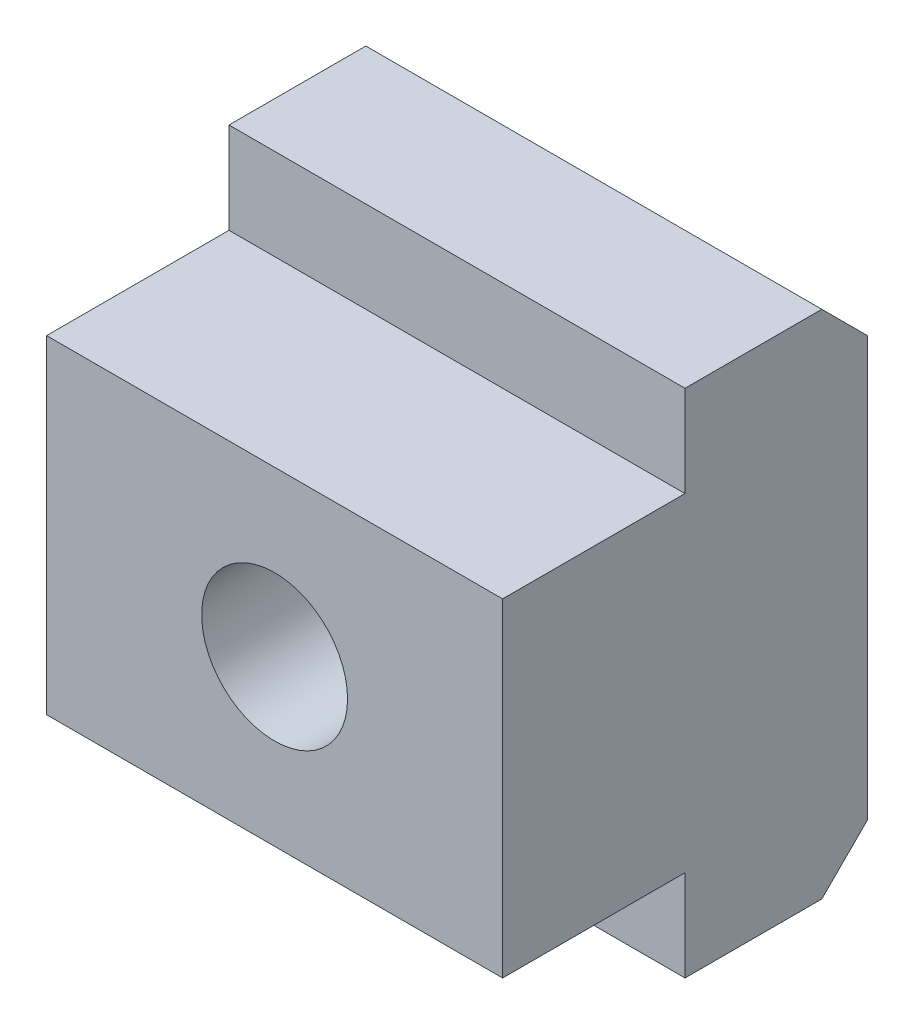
ISO-10303-21;
HEADER;
FILE_DESCRIPTION(('STEP AP214'),'2;1');
FILE_NAME('part.step','',(''),(''),'','','');
FILE_SCHEMA(('AUTOMOTIVE_DESIGN { 1 0 10303 214 1 1 1 1 }'));
ENDSEC;
DATA;
#1=APPLICATION_CONTEXT('core data for automotive mechanical design processes');
#2=APPLICATION_PROTOCOL_DEFINITION('international standard','automotive_design',2000,#1);
#3=PRODUCT_CONTEXT('',#1,'mechanical');
#4=PRODUCT('Part','Part','',(#3));
#5=PRODUCT_RELATED_PRODUCT_CATEGORY('part','',(#4));
#6=PRODUCT_DEFINITION_FORMATION('','',#4);
#7=PRODUCT_DEFINITION_CONTEXT('part definition',#1,'design');
#8=PRODUCT_DEFINITION('design','',#6,#7);
#9=PRODUCT_DEFINITION_SHAPE('','',#8);
#10=(LENGTH_UNIT() NAMED_UNIT(*) SI_UNIT(.MILLI.,.METRE.));
#11=(NAMED_UNIT(*) PLANE_ANGLE_UNIT() SI_UNIT($,.RADIAN.));
#12=(NAMED_UNIT(*) SI_UNIT($,.STERADIAN.) SOLID_ANGLE_UNIT());
#13=UNCERTAINTY_MEASURE_WITH_UNIT(LENGTH_MEASURE(1.E-05),#10,'distance_accuracy_value','');
#14=(GEOMETRIC_REPRESENTATION_CONTEXT(3) GLOBAL_UNCERTAINTY_ASSIGNED_CONTEXT((#13)) GLOBAL_UNIT_ASSIGNED_CONTEXT((#10,
#11,#12)) REPRESENTATION_CONTEXT('',''));
#15=CARTESIAN_POINT('',(0.,0.,0.));
#16=DIRECTION('',(0.,0.,1.));
#17=DIRECTION('',(1.,0.,0.));
#18=AXIS2_PLACEMENT_3D('',#15,#16,#17);
#19=CARTESIAN_POINT('',(12.5,-9.00000000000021,10.0000000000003));
#20=DIRECTION('',(0.,1.,0.));
#21=DIRECTION('',(0.,0.,1.));
#22=AXIS2_PLACEMENT_3D('',#19,#20,#21);
#23=PLANE('',#22);
#24=DIRECTION('',(0.,0.,-1.));
#25=VECTOR('',#24,1.);
#26=CARTESIAN_POINT('',(-12.5,-9.00000000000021,10.0000000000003));
#27=LINE('',#26,#25);
#28=CARTESIAN_POINT('',(-12.5,-9.00000000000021,10.0000000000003));
#29=VERTEX_POINT('',#28);
#30=CARTESIAN_POINT('',(-12.5,-9.00000000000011,2.70616862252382E-13));
#31=VERTEX_POINT('',#30);
#32=EDGE_CURVE('E94',#29,#31,#27,.T.);
#33=ORIENTED_EDGE('',*,*,#32,.T.);
#34=DIRECTION('',(-1.,0.,0.));
#35=VECTOR('',#34,1.);
#36=CARTESIAN_POINT('',(12.5,-9.00000000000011,2.70616862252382E-13));
#37=LINE('',#36,#35);
#38=CARTESIAN_POINT('',(12.5,-9.00000000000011,2.70616862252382E-13));
#39=VERTEX_POINT('',#38);
#40=EDGE_CURVE('E9',#39,#31,#37,.T.);
#41=ORIENTED_EDGE('',*,*,#40,.F.);
#42=DIRECTION('',(0.,0.,-1.));
#43=VECTOR('',#42,1.);
#44=CARTESIAN_POINT('',(12.5,-9.00000000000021,10.0000000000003));
#45=LINE('',#44,#43);
#46=CARTESIAN_POINT('',(12.5,-9.00000000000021,10.0000000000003));
#47=VERTEX_POINT('',#46);
#48=EDGE_CURVE('E130',#47,#39,#45,.T.);
#49=ORIENTED_EDGE('',*,*,#48,.F.);
#50=DIRECTION('',(-1.,0.,0.));
#51=VECTOR('',#50,1.);
#52=CARTESIAN_POINT('',(12.5,-9.00000000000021,10.0000000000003));
#53=LINE('',#52,#51);
#54=EDGE_CURVE('E107',#47,#29,#53,.T.);
#55=ORIENTED_EDGE('',*,*,#54,.T.);
#56=EDGE_LOOP('',(#33,#41,#49,#55));
#57=FACE_BOUND('',#56,.T.);
#58=ADVANCED_FACE('F14',(#57),#23,.F.);
#59=CARTESIAN_POINT('',(12.5,-9.00000000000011,2.70616862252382E-13));
#60=DIRECTION('',(0.,0.,-1.));
#61=DIRECTION('',(0.,1.,0.));
#62=AXIS2_PLACEMENT_3D('',#59,#60,#61);
#63=PLANE('',#62);
#64=DIRECTION('',(0.,-1.,0.));
#65=VECTOR('',#64,1.);
#66=CARTESIAN_POINT('',(-12.5,-9.00000000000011,2.70616862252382E-13));
#67=LINE('',#66,#65);
#68=CARTESIAN_POINT('',(-12.5,-14.0000000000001,1.09287578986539E-13));
#69=VERTEX_POINT('',#68);
#70=EDGE_CURVE('E90',#31,#69,#67,.T.);
#71=ORIENTED_EDGE('',*,*,#70,.T.);
#72=DIRECTION('',(-1.,0.,0.));
#73=VECTOR('',#72,1.);
#74=CARTESIAN_POINT('',(12.5,-14.0000000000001,1.09287578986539E-13));
#75=LINE('',#74,#73);
#76=CARTESIAN_POINT('',(12.5,-14.0000000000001,1.09287578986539E-13));
#77=VERTEX_POINT('',#76);
#78=EDGE_CURVE('E21',#77,#69,#75,.T.);
#79=ORIENTED_EDGE('',*,*,#78,.F.);
#80=DIRECTION('',(0.,-1.,0.));
#81=VECTOR('',#80,1.);
#82=CARTESIAN_POINT('',(12.5,-9.00000000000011,2.70616862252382E-13));
#83=LINE('',#82,#81);
#84=EDGE_CURVE('E103',#39,#77,#83,.T.);
#85=ORIENTED_EDGE('',*,*,#84,.F.);
#86=ORIENTED_EDGE('',*,*,#40,.T.);
#87=EDGE_LOOP('',(#71,#79,#85,#86));
#88=FACE_BOUND('',#87,.T.);
#89=ADVANCED_FACE('F102',(#88),#63,.F.);
#90=CARTESIAN_POINT('',(12.5,-14.0000000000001,1.09287578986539E-13));
#91=DIRECTION('',(0.,1.,0.));
#92=DIRECTION('',(0.,0.,1.));
#93=AXIS2_PLACEMENT_3D('',#90,#91,#92);
#94=PLANE('',#93);
#95=DIRECTION('',(0.,0.,-1.));
#96=VECTOR('',#95,1.);
#97=CARTESIAN_POINT('',(-12.5,-14.0000000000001,1.09287578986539E-13));
#98=LINE('',#97,#96);
#99=CARTESIAN_POINT('',(-12.5,-14.,-7.49999999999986));
#100=VERTEX_POINT('',#99);
#101=EDGE_CURVE('E96',#69,#100,#98,.T.);
#102=ORIENTED_EDGE('',*,*,#101,.T.);
#103=DIRECTION('',(-1.,0.,0.));
#104=VECTOR('',#103,1.);
#105=CARTESIAN_POINT('',(12.5,-14.,-7.49999999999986));
#106=LINE('',#105,#104);
#107=CARTESIAN_POINT('',(12.5,-14.,-7.49999999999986));
#108=VERTEX_POINT('',#107);
#109=EDGE_CURVE('E166',#108,#100,#106,.T.);
#110=ORIENTED_EDGE('',*,*,#109,.F.);
#111=DIRECTION('',(0.,0.,-1.));
#112=VECTOR('',#111,1.);
#113=CARTESIAN_POINT('',(12.5,-14.0000000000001,1.09287578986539E-13));
#114=LINE('',#113,#112);
#115=EDGE_CURVE('E133',#77,#108,#114,.T.);
#116=ORIENTED_EDGE('',*,*,#115,.F.);
#117=ORIENTED_EDGE('',*,*,#78,.T.);
#118=EDGE_LOOP('',(#102,#110,#116,#117));
#119=FACE_BOUND('',#118,.T.);
#120=ADVANCED_FACE('F170',(#119),#94,.F.);
#121=CARTESIAN_POINT('',(12.5,-14.,-7.49999999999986));
#122=DIRECTION('',(0.,0.70710678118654,0.707106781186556));
#123=DIRECTION('',(0.,-0.707106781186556,0.70710678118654));
#124=AXIS2_PLACEMENT_3D('',#121,#122,#123);
#125=PLANE('',#124);
#126=DIRECTION('',(0.,0.707106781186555,-0.70710678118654));
#127=VECTOR('',#126,1.);
#128=CARTESIAN_POINT('',(-12.5,-14.,-7.49999999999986));
#129=LINE('',#128,#127);
#130=CARTESIAN_POINT('',(-12.5,-11.5,-9.99999999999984));
#131=VERTEX_POINT('',#130);
#132=EDGE_CURVE('E116',#100,#131,#129,.T.);
#133=ORIENTED_EDGE('',*,*,#132,.T.);
#134=DIRECTION('',(-1.,0.,0.));
#135=VECTOR('',#134,1.);
#136=CARTESIAN_POINT('',(12.5,-11.5,-9.99999999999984));
#137=LINE('',#136,#135);
#138=CARTESIAN_POINT('',(12.5,-11.5,-9.99999999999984));
#139=VERTEX_POINT('',#138);
#140=EDGE_CURVE('E163',#139,#131,#137,.T.);
#141=ORIENTED_EDGE('',*,*,#140,.F.);
#142=DIRECTION('',(0.,0.707106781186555,-0.70710678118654));
#143=VECTOR('',#142,1.);
#144=CARTESIAN_POINT('',(12.5,-14.,-7.49999999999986));
#145=LINE('',#144,#143);
#146=EDGE_CURVE('E135',#108,#139,#145,.T.);
#147=ORIENTED_EDGE('',*,*,#146,.F.);
#148=ORIENTED_EDGE('',*,*,#109,.T.);
#149=EDGE_LOOP('',(#133,#141,#147,#148));
#150=FACE_BOUND('',#149,.T.);
#151=ADVANCED_FACE('F178',(#150),#125,.F.);
#152=CARTESIAN_POINT('',(12.5,-11.5,-9.99999999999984));
#153=DIRECTION('',(0.,0.,1.));
#154=DIRECTION('',(0.,-1.,0.));
#155=AXIS2_PLACEMENT_3D('',#152,#153,#154);
#156=PLANE('',#155);
#157=CARTESIAN_POINT('',(0.,-1.85037170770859E-13,-10.));
#158=DIRECTION('',(0.,0.,1.));
#159=DIRECTION('',(1.,0.,0.));
#160=AXIS2_PLACEMENT_3D('',#157,#158,#159);
#161=CIRCLE('',#160,4.);
#162=CARTESIAN_POINT('',(4.,-1.85037170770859E-13,-10.));
#163=VERTEX_POINT('',#162);
#164=EDGE_CURVE('E111',#163,#163,#161,.T.);
#165=ORIENTED_EDGE('',*,*,#164,.T.);
#166=EDGE_LOOP('',(#165));
#167=FACE_BOUND('',#166,.T.);
#168=DIRECTION('',(0.,1.,0.));
#169=VECTOR('',#168,1.);
#170=CARTESIAN_POINT('',(-12.5,-11.5,-9.99999999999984));
#171=LINE('',#170,#169);
#172=CARTESIAN_POINT('',(-12.5,11.5,-9.99999999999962));
#173=VERTEX_POINT('',#172);
#174=EDGE_CURVE('E118',#131,#173,#171,.T.);
#175=ORIENTED_EDGE('',*,*,#174,.T.);
#176=DIRECTION('',(-1.,0.,0.));
#177=VECTOR('',#176,1.);
#178=CARTESIAN_POINT('',(12.5,11.5,-9.99999999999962));
#179=LINE('',#178,#177);
#180=CARTESIAN_POINT('',(12.5,11.5,-9.99999999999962));
#181=VERTEX_POINT('',#180);
#182=EDGE_CURVE('E160',#181,#173,#179,.T.);
#183=ORIENTED_EDGE('',*,*,#182,.F.);
#184=DIRECTION('',(0.,1.,0.));
#185=VECTOR('',#184,1.);
#186=CARTESIAN_POINT('',(12.5,-11.5,-9.99999999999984));
#187=LINE('',#186,#185);
#188=EDGE_CURVE('E137',#139,#181,#187,.T.);
#189=ORIENTED_EDGE('',*,*,#188,.F.);
#190=ORIENTED_EDGE('',*,*,#140,.T.);
#191=EDGE_LOOP('',(#175,#183,#189,#190));
#192=FACE_BOUND('',#191,.T.);
#193=ADVANCED_FACE('F181',(#167,#192),#156,.F.);
#194=CARTESIAN_POINT('',(12.5,11.5,-9.99999999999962));
#195=DIRECTION('',(0.,-0.707106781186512,0.707106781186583));
#196=DIRECTION('',(0.,-0.707106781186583,-0.707106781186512));
#197=AXIS2_PLACEMENT_3D('',#194,#195,#196);
#198=PLANE('',#197);
#199=DIRECTION('',(0.,0.707106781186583,0.707106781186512));
#200=VECTOR('',#199,1.);
#201=CARTESIAN_POINT('',(-12.5,11.5,-9.99999999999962));
#202=LINE('',#201,#200);
#203=CARTESIAN_POINT('',(-12.5,13.9999999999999,-7.5));
#204=VERTEX_POINT('',#203);
#205=EDGE_CURVE('E120',#173,#204,#202,.T.);
#206=ORIENTED_EDGE('',*,*,#205,.T.);
#207=DIRECTION('',(-1.,0.,0.));
#208=VECTOR('',#207,1.);
#209=CARTESIAN_POINT('',(12.5,13.9999999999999,-7.5));
#210=LINE('',#209,#208);
#211=CARTESIAN_POINT('',(12.5,13.9999999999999,-7.5));
#212=VERTEX_POINT('',#211);
#213=EDGE_CURVE('E157',#212,#204,#210,.T.);
#214=ORIENTED_EDGE('',*,*,#213,.F.);
#215=DIRECTION('',(0.,0.707106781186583,0.707106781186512));
#216=VECTOR('',#215,1.);
#217=CARTESIAN_POINT('',(12.5,11.5,-9.99999999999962));
#218=LINE('',#217,#216);
#219=EDGE_CURVE('E139',#181,#212,#218,.T.);
#220=ORIENTED_EDGE('',*,*,#219,.F.);
#221=ORIENTED_EDGE('',*,*,#182,.T.);
#222=EDGE_LOOP('',(#206,#214,#220,#221));
#223=FACE_BOUND('',#222,.T.);
#224=ADVANCED_FACE('F186',(#223),#198,.F.);
#225=CARTESIAN_POINT('',(12.5,13.9999999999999,-7.5));
#226=DIRECTION('',(0.,-1.,0.));
#227=DIRECTION('',(1.,0.,0.));
#228=AXIS2_PLACEMENT_3D('',#225,#226,#227);
#229=PLANE('',#228);
#230=DIRECTION('',(0.,0.,1.));
#231=VECTOR('',#230,1.);
#232=CARTESIAN_POINT('',(-12.5,13.9999999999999,-7.5));
#233=LINE('',#232,#231);
#234=CARTESIAN_POINT('',(-12.5,13.9999999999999,0.));
#235=VERTEX_POINT('',#234);
#236=EDGE_CURVE('E122',#204,#235,#233,.T.);
#237=ORIENTED_EDGE('',*,*,#236,.T.);
#238=DIRECTION('',(-1.,0.,0.));
#239=VECTOR('',#238,1.);
#240=CARTESIAN_POINT('',(12.5,13.9999999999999,0.));
#241=LINE('',#240,#239);
#242=CARTESIAN_POINT('',(12.5,13.9999999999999,0.));
#243=VERTEX_POINT('',#242);
#244=EDGE_CURVE('E154',#243,#235,#241,.T.);
#245=ORIENTED_EDGE('',*,*,#244,.F.);
#246=DIRECTION('',(0.,0.,1.));
#247=VECTOR('',#246,1.);
#248=CARTESIAN_POINT('',(12.5,13.9999999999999,-7.5));
#249=LINE('',#248,#247);
#250=EDGE_CURVE('E141',#212,#243,#249,.T.);
#251=ORIENTED_EDGE('',*,*,#250,.F.);
#252=ORIENTED_EDGE('',*,*,#213,.T.);
#253=EDGE_LOOP('',(#237,#245,#251,#252));
#254=FACE_BOUND('',#253,.T.);
#255=ADVANCED_FACE('F192',(#254),#229,.F.);
#256=CARTESIAN_POINT('',(12.5,13.9999999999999,0.));
#257=DIRECTION('',(0.,0.,-1.));
#258=DIRECTION('',(-1.,0.,0.));
#259=AXIS2_PLACEMENT_3D('',#256,#257,#258);
#260=PLANE('',#259);
#261=DIRECTION('',(0.,-1.,0.));
#262=VECTOR('',#261,1.);
#263=CARTESIAN_POINT('',(-12.5,13.9999999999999,0.));
#264=LINE('',#263,#262);
#265=CARTESIAN_POINT('',(-12.5,8.99999999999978,0.));
#266=VERTEX_POINT('',#265);
#267=EDGE_CURVE('E124',#235,#266,#264,.T.);
#268=ORIENTED_EDGE('',*,*,#267,.T.);
#269=DIRECTION('',(-1.,0.,0.));
#270=VECTOR('',#269,1.);
#271=CARTESIAN_POINT('',(12.5,8.99999999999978,0.));
#272=LINE('',#271,#270);
#273=CARTESIAN_POINT('',(12.5,8.99999999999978,0.));
#274=VERTEX_POINT('',#273);
#275=EDGE_CURVE('E151',#274,#266,#272,.T.);
#276=ORIENTED_EDGE('',*,*,#275,.F.);
#277=DIRECTION('',(0.,-1.,0.));
#278=VECTOR('',#277,1.);
#279=CARTESIAN_POINT('',(12.5,13.9999999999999,0.));
#280=LINE('',#279,#278);
#281=EDGE_CURVE('E143',#243,#274,#280,.T.);
#282=ORIENTED_EDGE('',*,*,#281,.F.);
#283=ORIENTED_EDGE('',*,*,#244,.T.);
#284=EDGE_LOOP('',(#268,#276,#282,#283));
#285=FACE_BOUND('',#284,.T.);
#286=ADVANCED_FACE('F196',(#285),#260,.F.);
#287=CARTESIAN_POINT('',(12.5,8.99999999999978,0.));
#288=DIRECTION('',(0.,-1.,0.));
#289=DIRECTION('',(1.,0.,0.));
#290=AXIS2_PLACEMENT_3D('',#287,#288,#289);
#291=PLANE('',#290);
#292=DIRECTION('',(0.,0.,1.));
#293=VECTOR('',#292,1.);
#294=CARTESIAN_POINT('',(-12.5,8.99999999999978,0.));
#295=LINE('',#294,#293);
#296=CARTESIAN_POINT('',(-12.5,8.99999999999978,10.0000000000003));
#297=VERTEX_POINT('',#296);
#298=EDGE_CURVE('E126',#266,#297,#295,.T.);
#299=ORIENTED_EDGE('',*,*,#298,.T.);
#300=DIRECTION('',(-1.,0.,0.));
#301=VECTOR('',#300,1.);
#302=CARTESIAN_POINT('',(12.5,8.99999999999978,10.0000000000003));
#303=LINE('',#302,#301);
#304=CARTESIAN_POINT('',(12.5,8.99999999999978,10.0000000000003));
#305=VERTEX_POINT('',#304);
#306=EDGE_CURVE('E148',#305,#297,#303,.T.);
#307=ORIENTED_EDGE('',*,*,#306,.F.);
#308=DIRECTION('',(0.,0.,1.));
#309=VECTOR('',#308,1.);
#310=CARTESIAN_POINT('',(12.5,8.99999999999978,0.));
#311=LINE('',#310,#309);
#312=EDGE_CURVE('E33',#274,#305,#311,.T.);
#313=ORIENTED_EDGE('',*,*,#312,.F.);
#314=ORIENTED_EDGE('',*,*,#275,.T.);
#315=EDGE_LOOP('',(#299,#307,#313,#314));
#316=FACE_BOUND('',#315,.T.);
#317=ADVANCED_FACE('F199',(#316),#291,.F.);
#318=CARTESIAN_POINT('',(12.5,8.99999999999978,10.0000000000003));
#319=DIRECTION('',(0.,0.,-1.));
#320=DIRECTION('',(0.,1.,0.));
#321=AXIS2_PLACEMENT_3D('',#318,#319,#320);
#322=PLANE('',#321);
#323=CARTESIAN_POINT('',(0.,-1.85037170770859E-13,10.0000000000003));
#324=DIRECTION('',(0.,0.,1.));
#325=DIRECTION('',(1.,0.,0.));
#326=AXIS2_PLACEMENT_3D('',#323,#324,#325);
#327=CIRCLE('',#326,4.);
#328=CARTESIAN_POINT('',(4.,-1.85037170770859E-13,10.0000000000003));
#329=VERTEX_POINT('',#328);
#330=EDGE_CURVE('E108',#329,#329,#327,.T.);
#331=ORIENTED_EDGE('',*,*,#330,.F.);
#332=EDGE_LOOP('',(#331));
#333=FACE_BOUND('',#332,.T.);
#334=DIRECTION('',(0.,-1.,0.));
#335=VECTOR('',#334,1.);
#336=CARTESIAN_POINT('',(-12.5,8.99999999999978,10.0000000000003));
#337=LINE('',#336,#335);
#338=EDGE_CURVE('E128',#297,#29,#337,.T.);
#339=ORIENTED_EDGE('',*,*,#338,.T.);
#340=ORIENTED_EDGE('',*,*,#54,.F.);
#341=DIRECTION('',(0.,-1.,0.));
#342=VECTOR('',#341,1.);
#343=CARTESIAN_POINT('',(12.5,8.99999999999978,10.0000000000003));
#344=LINE('',#343,#342);
#345=EDGE_CURVE('E28',#305,#47,#344,.T.);
#346=ORIENTED_EDGE('',*,*,#345,.F.);
#347=ORIENTED_EDGE('',*,*,#306,.T.);
#348=EDGE_LOOP('',(#339,#340,#346,#347));
#349=FACE_BOUND('',#348,.T.);
#350=ADVANCED_FACE('F201',(#333,#349),#322,.F.);
#351=CARTESIAN_POINT('',(12.5,-9.,-9.99999999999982));
#352=DIRECTION('',(1.,0.,0.));
#353=DIRECTION('',(0.,1.,0.));
#354=AXIS2_PLACEMENT_3D('',#351,#352,#353);
#355=PLANE('',#354);
#356=ORIENTED_EDGE('',*,*,#48,.T.);
#357=ORIENTED_EDGE('',*,*,#84,.T.);
#358=ORIENTED_EDGE('',*,*,#115,.T.);
#359=ORIENTED_EDGE('',*,*,#146,.T.);
#360=ORIENTED_EDGE('',*,*,#188,.T.);
#361=ORIENTED_EDGE('',*,*,#219,.T.);
#362=ORIENTED_EDGE('',*,*,#250,.T.);
#363=ORIENTED_EDGE('',*,*,#281,.T.);
#364=ORIENTED_EDGE('',*,*,#312,.T.);
#365=ORIENTED_EDGE('',*,*,#345,.T.);
#366=EDGE_LOOP('',(#356,#357,#358,#359,#360,#361,#362,#363,#364,#365));
#367=FACE_BOUND('',#366,.T.);
#368=ADVANCED_FACE('F173',(#367),#355,.T.);
#369=CARTESIAN_POINT('',(-12.5,-9.,-9.99999999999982));
#370=DIRECTION('',(1.,0.,0.));
#371=DIRECTION('',(0.,1.,0.));
#372=AXIS2_PLACEMENT_3D('',#369,#370,#371);
#373=PLANE('',#372);
#374=ORIENTED_EDGE('',*,*,#32,.F.);
#375=ORIENTED_EDGE('',*,*,#338,.F.);
#376=ORIENTED_EDGE('',*,*,#298,.F.);
#377=ORIENTED_EDGE('',*,*,#267,.F.);
#378=ORIENTED_EDGE('',*,*,#236,.F.);
#379=ORIENTED_EDGE('',*,*,#205,.F.);
#380=ORIENTED_EDGE('',*,*,#174,.F.);
#381=ORIENTED_EDGE('',*,*,#132,.F.);
#382=ORIENTED_EDGE('',*,*,#101,.F.);
#383=ORIENTED_EDGE('',*,*,#70,.F.);
#384=EDGE_LOOP('',(#374,#375,#376,#377,#378,#379,#380,#381,#382,#383));
#385=FACE_BOUND('',#384,.T.);
#386=ADVANCED_FACE('F91',(#385),#373,.F.);
#387=CARTESIAN_POINT('',(0.,-1.85037170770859E-13,10.0000000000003));
#388=DIRECTION('',(0.,0.,1.));
#389=DIRECTION('',(1.,0.,0.));
#390=AXIS2_PLACEMENT_3D('',#387,#388,#389);
#391=CYLINDRICAL_SURFACE('',#390,4.);
#392=ORIENTED_EDGE('',*,*,#164,.F.);
#393=EDGE_LOOP('',(#392));
#394=FACE_BOUND('',#393,.T.);
#395=ORIENTED_EDGE('',*,*,#330,.T.);
#396=EDGE_LOOP('',(#395));
#397=FACE_BOUND('',#396,.T.);
#398=ADVANCED_FACE('F305',(#394,#397),#391,.F.);
#399=CLOSED_SHELL('',(#58,#89,#120,#151,#193,#224,#255,#286,#317,#350,#368,#386,#398));
#400=MANIFOLD_SOLID_BREP('B1',#399);
#401=ADVANCED_BREP_SHAPE_REPRESENTATION('',(#18,#400),#14);
#402=SHAPE_DEFINITION_REPRESENTATION(#9,#401);
ENDSEC;
END-ISO-10303-21;
